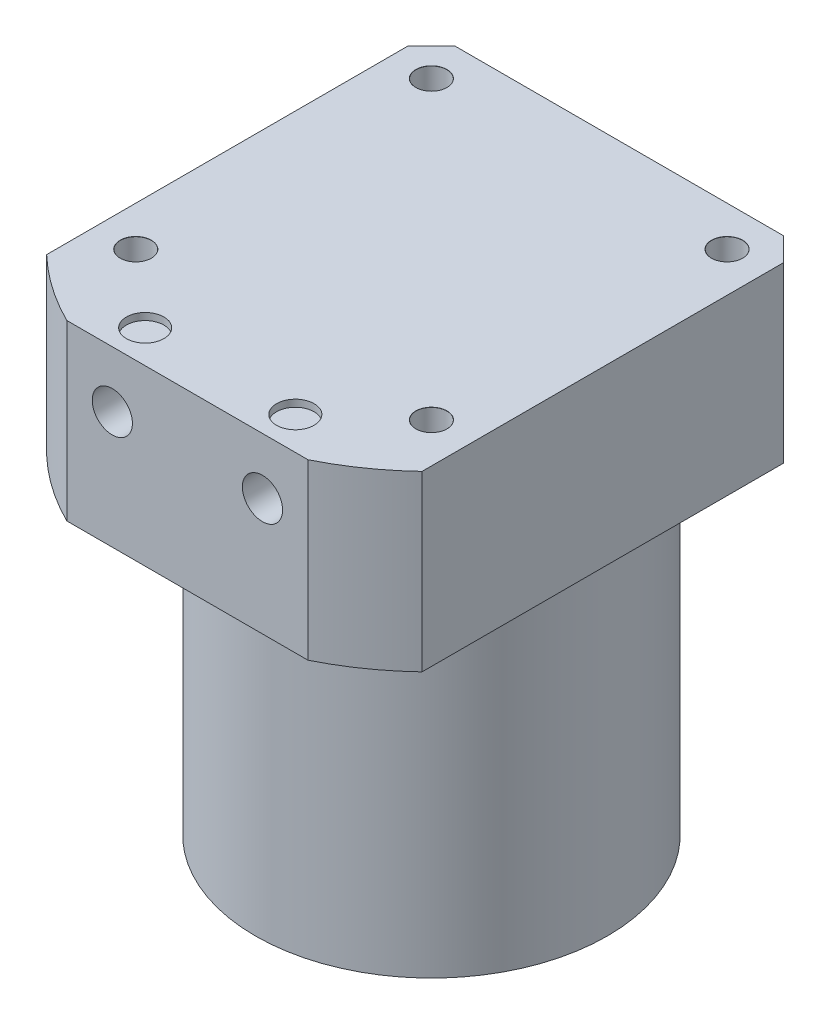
from build123d import *

# Parameters (mm, degrees)
SKETCH2_OUTSIDE_W                            = 157.282
SKETCH2_OUTSIDE_H                            = 157.282
SKETCH2_OUTSIDE_W_2                          = 80
SKETCH2_OUTSIDE_H_2                          = 92
CUT_EXTRUDE2_DEPTH                           = 136.617108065
CHAMFER1_SIZE                                = 5
F_8_0_8_DIAMETER_HOLE1_D                     = 8
F_8_0_8_DIAMETER_HOLE1_DEPTH                 = 1.5
G1_8_TAPPED_HOLE1_D                          = 8.566
G1_8_TAPPED_HOLE1_DEPTH                      = 22.18
CBORE_FOR_M6_HEX_SOCKET_HEAD_CAP_SCR_2_COUNT = 2
CBORE_FOR_M6_HEX_SOCKET_HEAD_CAP_SCR_2_PITCH = 63
CBORE_FOR_M6_HEX_SOCKET_HEAD_CAP_SCR_3_COUNT = 2
CBORE_FOR_M6_HEX_SOCKET_HEAD_CAP_SCR_3_PITCH = 89.09545443
CBORE_FOR_M6_HEX_SOCKET_HEAD_CAP_SCR_4_COUNT = 2
CBORE_FOR_M6_HEX_SOCKET_HEAD_CAP_SCR_4_PITCH = 63


with BuildPart() as part:
    # Sketch1 → Revolve1 (revolve)
    with BuildSketch(Plane.XY, mode=Mode.PRIVATE) as revolve1_sk:
        Polygon((0, 0), (-37.5, 0), (-37.5, 71), (-58, 71), (-58, 108), (0, 108), align=None)
    revolve(revolve1_sk.sketch.rotate(Axis((0, 87.050829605, 0), (0, -1, 0)), 270), axis=Axis((0, 87.050829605, 0), (0, -1, 0)))

    # Sketch2 outside → Cut-Extrude2 (cut, through all)
    with BuildSketch(Plane(origin=(0, 108, 0), x_dir=(1, 0, 0), z_dir=(0, 1, 0))):
        Rectangle(SKETCH2_OUTSIDE_W, SKETCH2_OUTSIDE_H)
        with Locations((0, -6)):
            Rectangle(SKETCH2_OUTSIDE_W_2, SKETCH2_OUTSIDE_H_2, mode=Mode.SUBTRACT)
    extrude(amount=-CUT_EXTRUDE2_DEPTH, mode=Mode.SUBTRACT)

    # Chamfer1
    chamfer1_edges = [part.edges().sort_by_distance(p)[0] for p in [
        (-40, 89.5, -40),
        (40, 89.5, -40),
    ]]
    chamfer(chamfer1_edges, length=CHAMFER1_SIZE)

    # 8.0 _8_ Diameter Hole1
    with Locations(Plane(origin=(-22.940510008, 108, 22.705104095), x_dir=(1, 0, 0), z_dir=(0, 1, 0))):
        with Locations((6.940510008, -22.294895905), (38.940510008, -22.294895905)):
            Hole(F_8_0_8_DIAMETER_HOLE1_D / 2, depth=F_8_0_8_DIAMETER_HOLE1_DEPTH)

    # G1_8 Tapped Hole1
    with Locations(Plane.XY.offset(52)):
        with Locations((-16, 96), (16, 96)):
            Hole(G1_8_TAPPED_HOLE1_D / 2, depth=G1_8_TAPPED_HOLE1_DEPTH)

    # Sketch7 → CBORE for M6 Hex Socket Head Cap Screw1 (revolve, cut)
    with BuildSketch(Plane(origin=(-31.5, 71, -31.5), x_dir=(0, 0, -1), z_dir=(1, 0, 0))):
        Polygon((0, 0), (0, 37), (3.325, 37), (3.3, 36.975), (3.3, 6), (5.5, 6), (5.5, 0), align=None)
    cbore_for_m6_hex_socket_head_cap_screw1 = revolve(axis=Axis((-31.5, 64.65, -31.5), (0, 1, 0)), mode=Mode.SUBTRACT)

    # CBORE for M6 Hex Socket Head Cap Scr 2: CBORE for M6 Hex Socket Head Cap Screw1 ×2
    with Locations(*[(i * CBORE_FOR_M6_HEX_SOCKET_HEAD_CAP_SCR_2_PITCH, 0, 0) for i in range(1, CBORE_FOR_M6_HEX_SOCKET_HEAD_CAP_SCR_2_COUNT)]):
        add(cbore_for_m6_hex_socket_head_cap_screw1, mode=Mode.SUBTRACT)

    # CBORE for M6 Hex Socket Head Cap Scr 3: CBORE for M6 Hex Socket Head Cap Screw1 ×2
    with Locations(*[Vector(0.7071067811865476, 0, 0.7071067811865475) * (i * CBORE_FOR_M6_HEX_SOCKET_HEAD_CAP_SCR_3_PITCH) for i in range(1, CBORE_FOR_M6_HEX_SOCKET_HEAD_CAP_SCR_3_COUNT)]):
        add(cbore_for_m6_hex_socket_head_cap_screw1, mode=Mode.SUBTRACT)

    # CBORE for M6 Hex Socket Head Cap Scr 4: CBORE for M6 Hex Socket Head Cap Screw1 ×2
    with Locations(*[(0, 0, i * CBORE_FOR_M6_HEX_SOCKET_HEAD_CAP_SCR_4_PITCH) for i in range(1, CBORE_FOR_M6_HEX_SOCKET_HEAD_CAP_SCR_4_COUNT)]):
        add(cbore_for_m6_hex_socket_head_cap_screw1, mode=Mode.SUBTRACT)


solid = part.part
